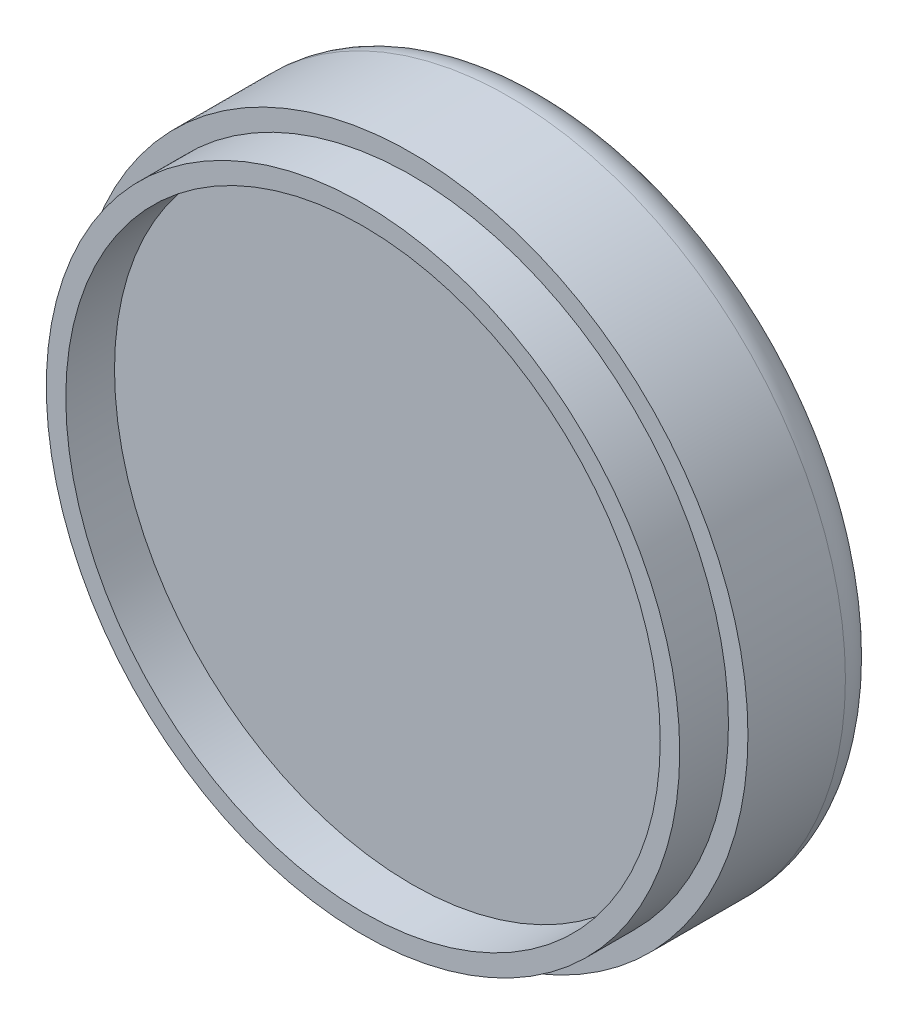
ISO-10303-21;
HEADER;
FILE_DESCRIPTION(('STEP AP214'),'2;1');
FILE_NAME('part.step','',(''),(''),'','','');
FILE_SCHEMA(('AUTOMOTIVE_DESIGN { 1 0 10303 214 1 1 1 1 }'));
ENDSEC;
DATA;
#1=APPLICATION_CONTEXT('core data for automotive mechanical design processes');
#2=APPLICATION_PROTOCOL_DEFINITION('international standard','automotive_design',2000,#1);
#3=PRODUCT_CONTEXT('',#1,'mechanical');
#4=PRODUCT('Part','Part','',(#3));
#5=PRODUCT_RELATED_PRODUCT_CATEGORY('part','',(#4));
#6=PRODUCT_DEFINITION_FORMATION('','',#4);
#7=PRODUCT_DEFINITION_CONTEXT('part definition',#1,'design');
#8=PRODUCT_DEFINITION('design','',#6,#7);
#9=PRODUCT_DEFINITION_SHAPE('','',#8);
#10=(LENGTH_UNIT() NAMED_UNIT(*) SI_UNIT(.MILLI.,.METRE.));
#11=(NAMED_UNIT(*) PLANE_ANGLE_UNIT() SI_UNIT($,.RADIAN.));
#12=(NAMED_UNIT(*) SI_UNIT($,.STERADIAN.) SOLID_ANGLE_UNIT());
#13=UNCERTAINTY_MEASURE_WITH_UNIT(LENGTH_MEASURE(1.E-05),#10,'distance_accuracy_value','');
#14=(GEOMETRIC_REPRESENTATION_CONTEXT(3) GLOBAL_UNCERTAINTY_ASSIGNED_CONTEXT((#13)) GLOBAL_UNIT_ASSIGNED_CONTEXT((#10,
#11,#12)) REPRESENTATION_CONTEXT('',''));
#15=CARTESIAN_POINT('',(0.,0.,0.));
#16=DIRECTION('',(0.,0.,1.));
#17=DIRECTION('',(1.,0.,0.));
#18=AXIS2_PLACEMENT_3D('',#15,#16,#17);
#19=CARTESIAN_POINT('',(0.,0.,14.));
#20=DIRECTION('',(0.,0.,-1.));
#21=DIRECTION('',(-1.,0.,0.));
#22=AXIS2_PLACEMENT_3D('',#19,#20,#21);
#23=CYLINDRICAL_SURFACE('',#22,34.5);
#24=CARTESIAN_POINT('',(0.,0.,4.));
#25=DIRECTION('',(0.,0.,1.));
#26=DIRECTION('',(1.,0.,0.));
#27=AXIS2_PLACEMENT_3D('',#24,#25,#26);
#28=CIRCLE('',#27,34.5);
#29=CARTESIAN_POINT('',(34.5,0.,4.));
#30=VERTEX_POINT('',#29);
#31=EDGE_CURVE('E51',#30,#30,#28,.T.);
#32=ORIENTED_EDGE('',*,*,#31,.T.);
#33=EDGE_LOOP('',(#32));
#34=FACE_BOUND('',#33,.T.);
#35=CARTESIAN_POINT('',(0.,0.,14.));
#36=DIRECTION('',(0.,0.,1.));
#37=DIRECTION('',(1.,0.,0.));
#38=AXIS2_PLACEMENT_3D('',#35,#36,#37);
#39=CIRCLE('',#38,34.5);
#40=CARTESIAN_POINT('',(34.5,0.,14.));
#41=VERTEX_POINT('',#40);
#42=EDGE_CURVE('E61',#41,#41,#39,.T.);
#43=ORIENTED_EDGE('',*,*,#42,.F.);
#44=EDGE_LOOP('',(#43));
#45=FACE_BOUND('',#44,.T.);
#46=ADVANCED_FACE('F43',(#34,#45),#23,.T.);
#47=CARTESIAN_POINT('',(0.,0.,14.));
#48=DIRECTION('',(0.,0.,1.));
#49=DIRECTION('',(1.,0.,0.));
#50=AXIS2_PLACEMENT_3D('',#47,#48,#49);
#51=PLANE('',#50);
#52=CARTESIAN_POINT('',(0.,0.,14.));
#53=DIRECTION('',(0.,0.,1.));
#54=DIRECTION('',(1.,0.,0.));
#55=AXIS2_PLACEMENT_3D('',#52,#53,#54);
#56=CIRCLE('',#55,32.5);
#57=CARTESIAN_POINT('',(32.5,0.,14.));
#58=VERTEX_POINT('',#57);
#59=EDGE_CURVE('E68',#58,#58,#56,.T.);
#60=ORIENTED_EDGE('',*,*,#59,.F.);
#61=EDGE_LOOP('',(#60));
#62=FACE_BOUND('',#61,.T.);
#63=ORIENTED_EDGE('',*,*,#42,.T.);
#64=EDGE_LOOP('',(#63));
#65=FACE_BOUND('',#64,.T.);
#66=ADVANCED_FACE('F95',(#62,#65),#51,.T.);
#67=CARTESIAN_POINT('',(0.,0.,0.));
#68=DIRECTION('',(0.,0.,1.));
#69=DIRECTION('',(1.,0.,0.));
#70=AXIS2_PLACEMENT_3D('',#67,#68,#69);
#71=PLANE('',#70);
#72=CARTESIAN_POINT('',(0.,0.,0.));
#73=DIRECTION('',(0.,0.,1.));
#74=DIRECTION('',(1.,0.,0.));
#75=AXIS2_PLACEMENT_3D('',#72,#73,#74);
#76=CIRCLE('',#75,30.5);
#77=CARTESIAN_POINT('',(30.5,0.,0.));
#78=VERTEX_POINT('',#77);
#79=EDGE_CURVE('E10',#78,#78,#76,.F.);
#80=ORIENTED_EDGE('',*,*,#79,.T.);
#81=EDGE_LOOP('',(#80));
#82=FACE_BOUND('',#81,.T.);
#83=ADVANCED_FACE('F86',(#82),#71,.F.);
#84=CARTESIAN_POINT('',(0.,0.,19.));
#85=DIRECTION('',(0.,0.,1.));
#86=DIRECTION('',(1.,0.,0.));
#87=AXIS2_PLACEMENT_3D('',#84,#85,#86);
#88=PLANE('',#87);
#89=CARTESIAN_POINT('',(0.,0.,19.));
#90=DIRECTION('',(0.,0.,1.));
#91=DIRECTION('',(1.,0.,0.));
#92=AXIS2_PLACEMENT_3D('',#89,#90,#91);
#93=CIRCLE('',#92,32.5);
#94=CARTESIAN_POINT('',(32.5,0.,19.));
#95=VERTEX_POINT('',#94);
#96=EDGE_CURVE('E67',#95,#95,#93,.T.);
#97=ORIENTED_EDGE('',*,*,#96,.T.);
#98=EDGE_LOOP('',(#97));
#99=FACE_BOUND('',#98,.T.);
#100=CARTESIAN_POINT('',(0.,0.,19.));
#101=DIRECTION('',(0.,0.,1.));
#102=DIRECTION('',(1.,0.,0.));
#103=AXIS2_PLACEMENT_3D('',#100,#101,#102);
#104=CIRCLE('',#103,30.5);
#105=CARTESIAN_POINT('',(30.5,0.,19.));
#106=VERTEX_POINT('',#105);
#107=EDGE_CURVE('E72',#106,#106,#104,.T.);
#108=ORIENTED_EDGE('',*,*,#107,.F.);
#109=EDGE_LOOP('',(#108));
#110=FACE_BOUND('',#109,.T.);
#111=ADVANCED_FACE('F83',(#99,#110),#88,.T.);
#112=CARTESIAN_POINT('',(0.,0.,19.));
#113=DIRECTION('',(0.,0.,-1.));
#114=DIRECTION('',(-1.,0.,0.));
#115=AXIS2_PLACEMENT_3D('',#112,#113,#114);
#116=CYLINDRICAL_SURFACE('',#115,32.5);
#117=ORIENTED_EDGE('',*,*,#96,.F.);
#118=EDGE_LOOP('',(#117));
#119=FACE_BOUND('',#118,.T.);
#120=ORIENTED_EDGE('',*,*,#59,.T.);
#121=EDGE_LOOP('',(#120));
#122=FACE_BOUND('',#121,.T.);
#123=ADVANCED_FACE('F85',(#119,#122),#116,.T.);
#124=CARTESIAN_POINT('',(0.,0.,19.));
#125=DIRECTION('',(0.,0.,-1.));
#126=DIRECTION('',(-1.,0.,0.));
#127=AXIS2_PLACEMENT_3D('',#124,#125,#126);
#128=CYLINDRICAL_SURFACE('',#127,30.5);
#129=ORIENTED_EDGE('',*,*,#107,.T.);
#130=EDGE_LOOP('',(#129));
#131=FACE_BOUND('',#130,.T.);
#132=CARTESIAN_POINT('',(0.,0.,14.));
#133=DIRECTION('',(0.,0.,1.));
#134=DIRECTION('',(1.,0.,0.));
#135=AXIS2_PLACEMENT_3D('',#132,#133,#134);
#136=CIRCLE('',#135,30.5);
#137=CARTESIAN_POINT('',(30.5,0.,14.));
#138=VERTEX_POINT('',#137);
#139=EDGE_CURVE('E56',#138,#138,#136,.F.);
#140=ORIENTED_EDGE('',*,*,#139,.T.);
#141=EDGE_LOOP('',(#140));
#142=FACE_BOUND('',#141,.T.);
#143=ADVANCED_FACE('F80',(#131,#142),#128,.F.);
#144=ORIENTED_EDGE('',*,*,#139,.F.);
#145=EDGE_LOOP('',(#144));
#146=FACE_BOUND('',#145,.T.);
#147=ADVANCED_FACE('F104',(#146),#51,.T.);
#148=CARTESIAN_POINT('',(0.,0.,4.));
#149=DIRECTION('',(0.,0.,1.));
#150=DIRECTION('',(1.,0.,0.));
#151=AXIS2_PLACEMENT_3D('',#148,#149,#150);
#152=TOROIDAL_SURFACE('',#151,30.5,4.);
#153=ORIENTED_EDGE('',*,*,#79,.F.);
#154=EDGE_LOOP('',(#153));
#155=FACE_BOUND('',#154,.T.);
#156=ORIENTED_EDGE('',*,*,#31,.F.);
#157=EDGE_LOOP('',(#156));
#158=FACE_BOUND('',#157,.T.);
#159=ADVANCED_FACE('F45',(#155,#158),#152,.T.);
#160=CLOSED_SHELL('',(#46,#66,#83,#111,#123,#143,#147,#159));
#161=MANIFOLD_SOLID_BREP('B2',#160);
#162=ADVANCED_BREP_SHAPE_REPRESENTATION('',(#18,#161),#14);
#163=SHAPE_DEFINITION_REPRESENTATION(#9,#162);
ENDSEC;
END-ISO-10303-21;
